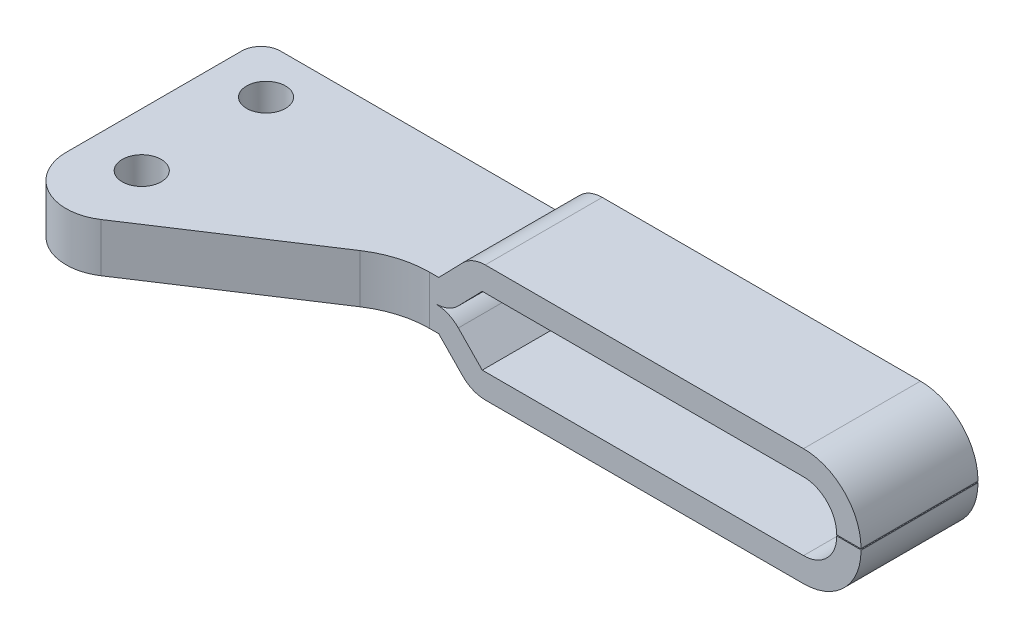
ISO-10303-21;
HEADER;
FILE_DESCRIPTION(('STEP AP214'),'2;1');
FILE_NAME('part.step','',(''),(''),'','','');
FILE_SCHEMA(('AUTOMOTIVE_DESIGN { 1 0 10303 214 1 1 1 1 }'));
ENDSEC;
DATA;
#1=APPLICATION_CONTEXT('core data for automotive mechanical design processes');
#2=APPLICATION_PROTOCOL_DEFINITION('international standard','automotive_design',2000,#1);
#3=PRODUCT_CONTEXT('',#1,'mechanical');
#4=PRODUCT('Part','Part','',(#3));
#5=PRODUCT_RELATED_PRODUCT_CATEGORY('part','',(#4));
#6=PRODUCT_DEFINITION_FORMATION('','',#4);
#7=PRODUCT_DEFINITION_CONTEXT('part definition',#1,'design');
#8=PRODUCT_DEFINITION('design','',#6,#7);
#9=PRODUCT_DEFINITION_SHAPE('','',#8);
#10=(LENGTH_UNIT() NAMED_UNIT(*) SI_UNIT(.MILLI.,.METRE.));
#11=(NAMED_UNIT(*) PLANE_ANGLE_UNIT() SI_UNIT($,.RADIAN.));
#12=(NAMED_UNIT(*) SI_UNIT($,.STERADIAN.) SOLID_ANGLE_UNIT());
#13=UNCERTAINTY_MEASURE_WITH_UNIT(LENGTH_MEASURE(1.E-05),#10,'distance_accuracy_value','');
#14=(GEOMETRIC_REPRESENTATION_CONTEXT(3) GLOBAL_UNCERTAINTY_ASSIGNED_CONTEXT((#13)) GLOBAL_UNIT_ASSIGNED_CONTEXT((#10,
#11,#12)) REPRESENTATION_CONTEXT('',''));
#15=CARTESIAN_POINT('',(0.,0.,0.));
#16=DIRECTION('',(0.,0.,1.));
#17=DIRECTION('',(1.,0.,0.));
#18=AXIS2_PLACEMENT_3D('',#15,#16,#17);
#19=CARTESIAN_POINT('',(4.37568668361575,18.4305081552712,-15.7399959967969));
#20=DIRECTION('',(-0.716910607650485,-0.697165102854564,0.));
#21=DIRECTION('',(-0.697165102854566,0.716910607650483,0.));
#22=AXIS2_PLACEMENT_3D('',#19,#20,#21);
#23=PLANE('',#22);
#24=DIRECTION('',(0.697165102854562,-0.716910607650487,0.));
#25=VECTOR('',#24,1.);
#26=CARTESIAN_POINT('',(24.946640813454,-2.72306818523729,-17.7399959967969));
#27=LINE('',#26,#25);
#28=CARTESIAN_POINT('',(24.7297164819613,-2.49999999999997,-17.7399959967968));
#29=VERTEX_POINT('',#28);
#30=CARTESIAN_POINT('',(27.1817485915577,-5.02147995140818,-17.7399959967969));
#31=VERTEX_POINT('',#30);
#32=EDGE_CURVE('E334',#29,#31,#27,.T.);
#33=ORIENTED_EDGE('',*,*,#32,.T.);
#34=DIRECTION('',(0.,0.,-1.));
#35=VECTOR('',#34,1.);
#36=CARTESIAN_POINT('',(27.1817485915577,-5.02147995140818,-15.7399959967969));
#37=LINE('',#36,#35);
#38=CARTESIAN_POINT('',(27.1817485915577,-5.02147995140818,-5.7399959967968));
#39=VERTEX_POINT('',#38);
#40=EDGE_CURVE('E349',#31,#39,#37,.F.);
#41=ORIENTED_EDGE('',*,*,#40,.T.);
#42=DIRECTION('',(-0.697165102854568,0.716910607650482,0.));
#43=VECTOR('',#42,1.);
#44=CARTESIAN_POINT('',(27.1817485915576,-5.02147995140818,-5.73999599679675));
#45=LINE('',#44,#43);
#46=CARTESIAN_POINT('',(24.7297164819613,-2.49999999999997,-5.73999599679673));
#47=VERTEX_POINT('',#46);
#48=EDGE_CURVE('E328',#39,#47,#45,.T.);
#49=ORIENTED_EDGE('',*,*,#48,.T.);
#50=DIRECTION('',(0.,0.,1.));
#51=VECTOR('',#50,1.);
#52=CARTESIAN_POINT('',(24.7297164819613,-2.49999999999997,-15.7399959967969));
#53=LINE('',#52,#51);
#54=EDGE_CURVE('E331',#29,#47,#53,.T.);
#55=ORIENTED_EDGE('',*,*,#54,.F.);
#56=EDGE_LOOP('',(#33,#41,#49,#55));
#57=FACE_BOUND('',#56,.T.);
#58=ADVANCED_FACE('F17',(#57),#23,.T.);
#59=CARTESIAN_POINT('',(29.5021014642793,-2.76503537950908,-24.1000840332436));
#60=DIRECTION('',(0.,0.,1.));
#61=DIRECTION('',(0.,1.,0.));
#62=AXIS2_PLACEMENT_3D('',#59,#60,#61);
#63=CYLINDRICAL_SURFACE('',#62,3.2366);
#64=ORIENTED_EDGE('',*,*,#40,.F.);
#65=CARTESIAN_POINT('',(29.5021014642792,-2.76503537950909,-17.7399959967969));
#66=DIRECTION('',(0.,0.,1.));
#67=DIRECTION('',(0.,1.,0.));
#68=AXIS2_PLACEMENT_3D('',#65,#66,#67);
#69=CIRCLE('',#68,3.2366);
#70=CARTESIAN_POINT('',(29.5021014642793,-6.00163537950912,-17.7399959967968));
#71=VERTEX_POINT('',#70);
#72=EDGE_CURVE('E329',#71,#31,#69,.F.);
#73=ORIENTED_EDGE('',*,*,#72,.F.);
#74=DIRECTION('',(0.,0.,1.));
#75=VECTOR('',#74,1.);
#76=CARTESIAN_POINT('',(29.5021014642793,-6.0016353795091,-24.1000840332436));
#77=LINE('',#76,#75);
#78=CARTESIAN_POINT('',(29.5021014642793,-6.00163537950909,-5.73999599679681));
#79=VERTEX_POINT('',#78);
#80=EDGE_CURVE('E356',#71,#79,#77,.T.);
#81=ORIENTED_EDGE('',*,*,#80,.T.);
#82=CARTESIAN_POINT('',(29.5021014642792,-2.76503537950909,-5.73999599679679));
#83=DIRECTION('',(0.,0.,1.));
#84=DIRECTION('',(0.,1.,0.));
#85=AXIS2_PLACEMENT_3D('',#82,#83,#84);
#86=CIRCLE('',#85,3.2366);
#87=EDGE_CURVE('E351',#39,#79,#86,.T.);
#88=ORIENTED_EDGE('',*,*,#87,.F.);
#89=EDGE_LOOP('',(#64,#73,#81,#88));
#90=FACE_BOUND('',#89,.T.);
#91=ADVANCED_FACE('F491',(#90),#63,.T.);
#92=CARTESIAN_POINT('',(-4.79847823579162,-6.00163537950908,-15.7399959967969));
#93=DIRECTION('',(0.,-1.,0.));
#94=DIRECTION('',(0.,0.,1.));
#95=AXIS2_PLACEMENT_3D('',#92,#93,#94);
#96=PLANE('',#95);
#97=ORIENTED_EDGE('',*,*,#80,.F.);
#98=DIRECTION('',(-1.,0.,0.));
#99=VECTOR('',#98,1.);
#100=CARTESIAN_POINT('',(69.5080963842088,-6.00163537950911,-17.7399959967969));
#101=LINE('',#100,#99);
#102=CARTESIAN_POINT('',(62.1500000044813,-6.00163537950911,-17.7399959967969));
#103=VERTEX_POINT('',#102);
#104=EDGE_CURVE('E361',#71,#103,#101,.F.);
#105=ORIENTED_EDGE('',*,*,#104,.T.);
#106=DIRECTION('',(0.,0.,1.));
#107=VECTOR('',#106,1.);
#108=CARTESIAN_POINT('',(62.1500000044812,-6.0016353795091,-15.7399959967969));
#109=LINE('',#108,#107);
#110=CARTESIAN_POINT('',(62.1500000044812,-6.0016353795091,-5.73999599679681));
#111=VERTEX_POINT('',#110);
#112=EDGE_CURVE('E370',#103,#111,#109,.T.);
#113=ORIENTED_EDGE('',*,*,#112,.T.);
#114=DIRECTION('',(1.,0.,0.));
#115=VECTOR('',#114,1.);
#116=CARTESIAN_POINT('',(19.5080963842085,-6.0016353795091,-5.73999599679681));
#117=LINE('',#116,#115);
#118=EDGE_CURVE('E364',#111,#79,#117,.F.);
#119=ORIENTED_EDGE('',*,*,#118,.T.);
#120=EDGE_LOOP('',(#97,#105,#113,#119));
#121=FACE_BOUND('',#120,.T.);
#122=ADVANCED_FACE('F497',(#121),#96,.T.);
#123=CARTESIAN_POINT('',(62.1500000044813,-0.10163537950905,-26.008891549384));
#124=DIRECTION('',(0.,0.,1.));
#125=DIRECTION('',(-1.,0.,0.));
#126=AXIS2_PLACEMENT_3D('',#123,#124,#125);
#127=CYLINDRICAL_SURFACE('',#126,5.9);
#128=DIRECTION('',(0.,0.,1.));
#129=VECTOR('',#128,1.);
#130=CARTESIAN_POINT('',(68.0500000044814,-0.101635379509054,-26.008891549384));
#131=LINE('',#130,#129);
#132=CARTESIAN_POINT('',(68.0500000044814,-0.101635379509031,-17.7399959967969));
#133=VERTEX_POINT('',#132);
#134=CARTESIAN_POINT('',(68.0500000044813,-0.101635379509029,-5.73999599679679));
#135=VERTEX_POINT('',#134);
#136=EDGE_CURVE('E386',#133,#135,#131,.T.);
#137=ORIENTED_EDGE('',*,*,#136,.T.);
#138=CARTESIAN_POINT('',(62.1500000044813,-0.101635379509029,-5.73999599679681));
#139=DIRECTION('',(0.,0.,1.));
#140=DIRECTION('',(-1.,0.,0.));
#141=AXIS2_PLACEMENT_3D('',#138,#139,#140);
#142=CIRCLE('',#141,5.9);
#143=EDGE_CURVE('E379',#111,#135,#142,.T.);
#144=ORIENTED_EDGE('',*,*,#143,.F.);
#145=ORIENTED_EDGE('',*,*,#112,.F.);
#146=CARTESIAN_POINT('',(62.1500000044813,-0.101635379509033,-17.7399959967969));
#147=DIRECTION('',(0.,0.,1.));
#148=DIRECTION('',(-1.,0.,0.));
#149=AXIS2_PLACEMENT_3D('',#146,#147,#148);
#150=CIRCLE('',#149,5.9);
#151=EDGE_CURVE('E373',#133,#103,#150,.F.);
#152=ORIENTED_EDGE('',*,*,#151,.F.);
#153=EDGE_LOOP('',(#137,#144,#145,#152));
#154=FACE_BOUND('',#153,.T.);
#155=ADVANCED_FACE('F515',(#154),#127,.T.);
#156=CARTESIAN_POINT('',(68.0500000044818,-74.354316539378,-15.7399959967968));
#157=DIRECTION('',(1.,0.,0.));
#158=DIRECTION('',(0.,-1.,0.));
#159=AXIS2_PLACEMENT_3D('',#156,#157,#158);
#160=PLANE('',#159);
#161=DIRECTION('',(0.,-1.,0.));
#162=VECTOR('',#161,1.);
#163=CARTESIAN_POINT('',(68.0500000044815,-0.0477419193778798,-17.7399959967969));
#164=LINE('',#163,#162);
#165=CARTESIAN_POINT('',(68.0500000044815,-0.0477419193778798,-17.7399959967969));
#166=VERTEX_POINT('',#165);
#167=EDGE_CURVE('E391',#133,#166,#164,.F.);
#168=ORIENTED_EDGE('',*,*,#167,.T.);
#169=DIRECTION('',(0.,0.,-1.));
#170=VECTOR('',#169,1.);
#171=CARTESIAN_POINT('',(68.0500000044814,-0.0477419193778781,-5.73999599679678));
#172=LINE('',#171,#170);
#173=CARTESIAN_POINT('',(68.0500000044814,-0.0477419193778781,-5.73999599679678));
#174=VERTEX_POINT('',#173);
#175=EDGE_CURVE('E300',#166,#174,#172,.F.);
#176=ORIENTED_EDGE('',*,*,#175,.T.);
#177=DIRECTION('',(0.,-1.,0.));
#178=VECTOR('',#177,1.);
#179=CARTESIAN_POINT('',(68.0500000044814,-50.0477419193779,-5.73999599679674));
#180=LINE('',#179,#178);
#181=EDGE_CURVE('E394',#174,#135,#180,.T.);
#182=ORIENTED_EDGE('',*,*,#181,.T.);
#183=ORIENTED_EDGE('',*,*,#136,.F.);
#184=EDGE_LOOP('',(#168,#176,#182,#183));
#185=FACE_BOUND('',#184,.T.);
#186=ADVANCED_FACE('F523',(#185),#160,.T.);
#187=CARTESIAN_POINT('',(68.0500000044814,-0.0477419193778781,-5.73999599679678));
#188=DIRECTION('',(0.,-1.,0.));
#189=DIRECTION('',(-1.,0.,0.));
#190=AXIS2_PLACEMENT_3D('',#187,#188,#189);
#191=PLANE('',#190);
#192=DIRECTION('',(1.,0.,0.));
#193=VECTOR('',#192,1.);
#194=CARTESIAN_POINT('',(68.0500000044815,-0.0477419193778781,-5.73999599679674));
#195=LINE('',#194,#193);
#196=CARTESIAN_POINT('',(65.5500000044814,-0.0477419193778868,-5.73999599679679));
#197=VERTEX_POINT('',#196);
#198=EDGE_CURVE('E399',#197,#174,#195,.T.);
#199=ORIENTED_EDGE('',*,*,#198,.T.);
#200=ORIENTED_EDGE('',*,*,#175,.F.);
#201=DIRECTION('',(-1.,0.,0.));
#202=VECTOR('',#201,1.);
#203=CARTESIAN_POINT('',(68.0500000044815,-0.0477419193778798,-17.7399959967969));
#204=LINE('',#203,#202);
#205=CARTESIAN_POINT('',(65.5500000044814,-0.0477419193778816,-17.7399959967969));
#206=VERTEX_POINT('',#205);
#207=EDGE_CURVE('E390',#166,#206,#204,.T.);
#208=ORIENTED_EDGE('',*,*,#207,.T.);
#209=DIRECTION('',(0.,0.,-1.));
#210=VECTOR('',#209,1.);
#211=CARTESIAN_POINT('',(65.5500000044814,-0.047741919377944,-15.7399959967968));
#212=LINE('',#211,#210);
#213=EDGE_CURVE('E380',#206,#197,#212,.F.);
#214=ORIENTED_EDGE('',*,*,#213,.T.);
#215=EDGE_LOOP('',(#199,#200,#208,#214));
#216=FACE_BOUND('',#215,.T.);
#217=ADVANCED_FACE('F519',(#216),#191,.F.);
#218=CARTESIAN_POINT('',(65.5500000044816,-74.3543165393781,-15.7399959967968));
#219=DIRECTION('',(1.,0.,0.));
#220=DIRECTION('',(0.,-1.,0.));
#221=AXIS2_PLACEMENT_3D('',#218,#219,#220);
#222=PLANE('',#221);
#223=DIRECTION('',(0.,-1.,0.));
#224=VECTOR('',#223,1.);
#225=CARTESIAN_POINT('',(65.5500000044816,-74.3543165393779,-5.73999599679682));
#226=LINE('',#225,#224);
#227=CARTESIAN_POINT('',(65.5500000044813,-0.101635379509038,-5.73999599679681));
#228=VERTEX_POINT('',#227);
#229=EDGE_CURVE('E377',#197,#228,#226,.T.);
#230=ORIENTED_EDGE('',*,*,#229,.F.);
#231=ORIENTED_EDGE('',*,*,#213,.F.);
#232=DIRECTION('',(0.,-1.,0.));
#233=VECTOR('',#232,1.);
#234=CARTESIAN_POINT('',(65.5500000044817,-74.3543165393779,-17.7399959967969));
#235=LINE('',#234,#233);
#236=CARTESIAN_POINT('',(65.5500000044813,-0.101635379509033,-17.7399959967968));
#237=VERTEX_POINT('',#236);
#238=EDGE_CURVE('E383',#237,#206,#235,.F.);
#239=ORIENTED_EDGE('',*,*,#238,.F.);
#240=DIRECTION('',(0.,0.,1.));
#241=VECTOR('',#240,1.);
#242=CARTESIAN_POINT('',(65.5500000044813,-0.101635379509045,-26.008891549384));
#243=LINE('',#242,#241);
#244=EDGE_CURVE('E374',#237,#228,#243,.T.);
#245=ORIENTED_EDGE('',*,*,#244,.T.);
#246=EDGE_LOOP('',(#230,#231,#239,#245));
#247=FACE_BOUND('',#246,.T.);
#248=ADVANCED_FACE('F511',(#247),#222,.F.);
#249=CARTESIAN_POINT('',(62.1500000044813,-0.10163537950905,-26.008891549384));
#250=DIRECTION('',(0.,0.,1.));
#251=DIRECTION('',(-1.,0.,0.));
#252=AXIS2_PLACEMENT_3D('',#249,#250,#251);
#253=CYLINDRICAL_SURFACE('',#252,3.4);
#254=CARTESIAN_POINT('',(62.1500000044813,-0.101635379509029,-5.73999599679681));
#255=DIRECTION('',(0.,0.,1.));
#256=DIRECTION('',(-1.,0.,0.));
#257=AXIS2_PLACEMENT_3D('',#254,#255,#256);
#258=CIRCLE('',#257,3.4);
#259=CARTESIAN_POINT('',(62.1500000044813,-3.50163537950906,-5.7399959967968));
#260=VERTEX_POINT('',#259);
#261=EDGE_CURVE('E367',#228,#260,#258,.F.);
#262=ORIENTED_EDGE('',*,*,#261,.F.);
#263=ORIENTED_EDGE('',*,*,#244,.F.);
#264=CARTESIAN_POINT('',(62.1500000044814,-0.101635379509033,-17.7399959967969));
#265=DIRECTION('',(0.,0.,1.));
#266=DIRECTION('',(-1.,0.,0.));
#267=AXIS2_PLACEMENT_3D('',#264,#265,#266);
#268=CIRCLE('',#267,3.4);
#269=CARTESIAN_POINT('',(62.1500000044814,-3.50163537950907,-17.7399959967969));
#270=VERTEX_POINT('',#269);
#271=EDGE_CURVE('E372',#270,#237,#268,.T.);
#272=ORIENTED_EDGE('',*,*,#271,.F.);
#273=DIRECTION('',(0.,0.,1.));
#274=VECTOR('',#273,1.);
#275=CARTESIAN_POINT('',(62.1500000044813,-3.50163537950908,-15.7399959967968));
#276=LINE('',#275,#274);
#277=EDGE_CURVE('E355',#270,#260,#276,.T.);
#278=ORIENTED_EDGE('',*,*,#277,.T.);
#279=EDGE_LOOP('',(#262,#263,#272,#278));
#280=FACE_BOUND('',#279,.T.);
#281=ADVANCED_FACE('F506',(#280),#253,.F.);
#282=CARTESIAN_POINT('',(-4.79847823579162,-3.50163537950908,-15.7399959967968));
#283=DIRECTION('',(0.,-1.,0.));
#284=DIRECTION('',(0.,0.,1.));
#285=AXIS2_PLACEMENT_3D('',#282,#283,#284);
#286=PLANE('',#285);
#287=ORIENTED_EDGE('',*,*,#277,.F.);
#288=DIRECTION('',(-1.,0.,0.));
#289=VECTOR('',#288,1.);
#290=CARTESIAN_POINT('',(-4.79847823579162,-3.50163537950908,-17.7399959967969));
#291=LINE('',#290,#289);
#292=CARTESIAN_POINT('',(29.1909494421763,-3.50163537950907,-17.7399959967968));
#293=VERTEX_POINT('',#292);
#294=EDGE_CURVE('E352',#293,#270,#291,.F.);
#295=ORIENTED_EDGE('',*,*,#294,.F.);
#296=DIRECTION('',(0.,0.,1.));
#297=VECTOR('',#296,1.);
#298=CARTESIAN_POINT('',(29.1909494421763,-3.50163537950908,-15.7399959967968));
#299=LINE('',#298,#297);
#300=CARTESIAN_POINT('',(29.1909494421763,-3.50163537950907,-5.73999599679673));
#301=VERTEX_POINT('',#300);
#302=EDGE_CURVE('E326',#293,#301,#299,.T.);
#303=ORIENTED_EDGE('',*,*,#302,.T.);
#304=DIRECTION('',(-1.,0.,0.));
#305=VECTOR('',#304,1.);
#306=CARTESIAN_POINT('',(-4.79847823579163,-3.50163537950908,-5.73999599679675));
#307=LINE('',#306,#305);
#308=EDGE_CURVE('E357',#260,#301,#307,.T.);
#309=ORIENTED_EDGE('',*,*,#308,.F.);
#310=EDGE_LOOP('',(#287,#295,#303,#309));
#311=FACE_BOUND('',#310,.T.);
#312=ADVANCED_FACE('F504',(#311),#286,.F.);
#313=CARTESIAN_POINT('',(24.4185644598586,-3.2366,-5.73999599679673));
#314=DIRECTION('',(0.,0.,-1.));
#315=DIRECTION('',(0.,-1.,0.));
#316=AXIS2_PLACEMENT_3D('',#313,#314,#315);
#317=PLANE('',#316);
#318=CARTESIAN_POINT('',(24.4185644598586,-3.2366,-5.73999599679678));
#319=DIRECTION('',(0.,0.,1.));
#320=DIRECTION('',(0.,1.,0.));
#321=AXIS2_PLACEMENT_3D('',#318,#319,#320);
#322=CIRCLE('',#321,3.2366);
#323=CARTESIAN_POINT('',(24.4185644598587,0.,-5.73999599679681));
#324=VERTEX_POINT('',#323);
#325=CARTESIAN_POINT('',(26.7389173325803,-0.98015542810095,-5.7399959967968));
#326=VERTEX_POINT('',#325);
#327=EDGE_CURVE('E420',#324,#326,#322,.F.);
#328=ORIENTED_EDGE('',*,*,#327,.F.);
#329=CARTESIAN_POINT('',(24.4185644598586,3.23660000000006,-5.73999599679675));
#330=DIRECTION('',(0.,0.,1.));
#331=DIRECTION('',(0.,1.,0.));
#332=AXIS2_PLACEMENT_3D('',#329,#330,#331);
#333=CIRCLE('',#332,3.2366);
#334=CARTESIAN_POINT('',(26.7389173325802,0.980155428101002,-5.73999599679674));
#335=VERTEX_POINT('',#334);
#336=EDGE_CURVE('E311',#335,#324,#333,.F.);
#337=ORIENTED_EDGE('',*,*,#336,.F.);
#338=DIRECTION('',(-0.697165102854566,-0.716910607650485,0.));
#339=VECTOR('',#338,1.);
#340=CARTESIAN_POINT('',(6.16796320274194,-20.1734209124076,-5.73999599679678));
#341=LINE('',#340,#339);
#342=CARTESIAN_POINT('',(29.1909494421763,3.50163537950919,-5.73999599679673));
#343=VERTEX_POINT('',#342);
#344=EDGE_CURVE('E227',#343,#335,#341,.T.);
#345=ORIENTED_EDGE('',*,*,#344,.F.);
#346=DIRECTION('',(-1.,0.,0.));
#347=VECTOR('',#346,1.);
#348=CARTESIAN_POINT('',(-4.79847823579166,3.50163537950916,-5.73999599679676));
#349=LINE('',#348,#347);
#350=CARTESIAN_POINT('',(62.1500000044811,3.5016353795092,-5.73999599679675));
#351=VERTEX_POINT('',#350);
#352=EDGE_CURVE('E236',#351,#343,#349,.T.);
#353=ORIENTED_EDGE('',*,*,#352,.F.);
#354=CARTESIAN_POINT('',(62.1500000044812,0.10163537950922,-5.73999599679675));
#355=DIRECTION('',(0.,0.,1.));
#356=DIRECTION('',(-1.,0.,0.));
#357=AXIS2_PLACEMENT_3D('',#354,#355,#356);
#358=CIRCLE('',#357,3.4);
#359=CARTESIAN_POINT('',(65.5500000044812,0.101635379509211,-5.73999599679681));
#360=VERTEX_POINT('',#359);
#361=EDGE_CURVE('E253',#351,#360,#358,.F.);
#362=ORIENTED_EDGE('',*,*,#361,.T.);
#363=DIRECTION('',(0.,1.,0.));
#364=VECTOR('',#363,1.);
#365=CARTESIAN_POINT('',(65.5500000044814,74.3543165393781,-5.73999599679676));
#366=LINE('',#365,#364);
#367=CARTESIAN_POINT('',(65.5500000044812,0.0477419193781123,-5.73999599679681));
#368=VERTEX_POINT('',#367);
#369=EDGE_CURVE('E262',#368,#360,#366,.T.);
#370=ORIENTED_EDGE('',*,*,#369,.F.);
#371=DIRECTION('',(1.,0.,0.));
#372=VECTOR('',#371,1.);
#373=CARTESIAN_POINT('',(65.5500000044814,0.0477419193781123,-5.7399959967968));
#374=LINE('',#373,#372);
#375=CARTESIAN_POINT('',(68.0500000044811,0.047741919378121,-5.73999599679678));
#376=VERTEX_POINT('',#375);
#377=EDGE_CURVE('E279',#376,#368,#374,.F.);
#378=ORIENTED_EDGE('',*,*,#377,.F.);
#379=DIRECTION('',(0.,-1.,0.));
#380=VECTOR('',#379,1.);
#381=CARTESIAN_POINT('',(68.050000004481,50.0477419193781,-5.7399959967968));
#382=LINE('',#381,#380);
#383=CARTESIAN_POINT('',(68.0500000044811,0.101635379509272,-5.7399959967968));
#384=VERTEX_POINT('',#383);
#385=EDGE_CURVE('E277',#384,#376,#382,.T.);
#386=ORIENTED_EDGE('',*,*,#385,.F.);
#387=CARTESIAN_POINT('',(62.1500000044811,0.10163537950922,-5.73999599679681));
#388=DIRECTION('',(0.,0.,1.));
#389=DIRECTION('',(-1.,0.,0.));
#390=AXIS2_PLACEMENT_3D('',#387,#388,#389);
#391=CIRCLE('',#390,5.9);
#392=CARTESIAN_POINT('',(62.1500000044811,6.00163537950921,-5.73999599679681));
#393=VERTEX_POINT('',#392);
#394=EDGE_CURVE('E289',#393,#384,#391,.F.);
#395=ORIENTED_EDGE('',*,*,#394,.F.);
#396=DIRECTION('',(1.,0.,0.));
#397=VECTOR('',#396,1.);
#398=CARTESIAN_POINT('',(19.5080963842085,6.00163537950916,-5.73999599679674));
#399=LINE('',#398,#397);
#400=CARTESIAN_POINT('',(29.5021014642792,6.00163537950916,-5.73999599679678));
#401=VERTEX_POINT('',#400);
#402=EDGE_CURVE('E245',#401,#393,#399,.T.);
#403=ORIENTED_EDGE('',*,*,#402,.F.);
#404=CARTESIAN_POINT('',(29.5021014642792,2.76503537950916,-5.73999599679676));
#405=DIRECTION('',(0.,0.,1.));
#406=DIRECTION('',(0.,1.,0.));
#407=AXIS2_PLACEMENT_3D('',#404,#405,#406);
#408=CIRCLE('',#407,3.2366);
#409=CARTESIAN_POINT('',(27.1817485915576,5.02147995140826,-5.73999599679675));
#410=VERTEX_POINT('',#409);
#411=EDGE_CURVE('E235',#410,#401,#408,.F.);
#412=ORIENTED_EDGE('',*,*,#411,.F.);
#413=DIRECTION('',(0.697165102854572,0.716910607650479,0.));
#414=VECTOR('',#413,1.);
#415=CARTESIAN_POINT('',(24.9466408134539,2.7230681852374,-5.73999599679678));
#416=LINE('',#415,#414);
#417=CARTESIAN_POINT('',(24.7297164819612,2.50000000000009,-5.73999599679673));
#418=VERTEX_POINT('',#417);
#419=EDGE_CURVE('E193',#418,#410,#416,.T.);
#420=ORIENTED_EDGE('',*,*,#419,.F.);
#421=DIRECTION('',(-1.,0.,0.));
#422=VECTOR('',#421,1.);
#423=CARTESIAN_POINT('',(-3.50000000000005,2.5,-5.7399959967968));
#424=LINE('',#423,#422);
#425=CARTESIAN_POINT('',(23.7944274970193,2.50000000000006,-5.73999599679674));
#426=VERTEX_POINT('',#425);
#427=EDGE_CURVE('E218',#418,#426,#424,.T.);
#428=ORIENTED_EDGE('',*,*,#427,.T.);
#429=DIRECTION('',(0.,-1.,0.));
#430=VECTOR('',#429,1.);
#431=CARTESIAN_POINT('',(23.7944274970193,-2.5,-5.73999599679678));
#432=LINE('',#431,#430);
#433=CARTESIAN_POINT('',(23.7944274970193,-2.5,-5.73999599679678));
#434=VERTEX_POINT('',#433);
#435=EDGE_CURVE('E433',#426,#434,#432,.T.);
#436=ORIENTED_EDGE('',*,*,#435,.T.);
#437=DIRECTION('',(-1.,0.,0.));
#438=VECTOR('',#437,1.);
#439=CARTESIAN_POINT('',(-3.5,-2.5,-5.73999599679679));
#440=LINE('',#439,#438);
#441=EDGE_CURVE('E333',#47,#434,#440,.T.);
#442=ORIENTED_EDGE('',*,*,#441,.F.);
#443=ORIENTED_EDGE('',*,*,#48,.F.);
#444=ORIENTED_EDGE('',*,*,#87,.T.);
#445=ORIENTED_EDGE('',*,*,#118,.F.);
#446=ORIENTED_EDGE('',*,*,#143,.T.);
#447=ORIENTED_EDGE('',*,*,#181,.F.);
#448=ORIENTED_EDGE('',*,*,#198,.F.);
#449=ORIENTED_EDGE('',*,*,#229,.T.);
#450=ORIENTED_EDGE('',*,*,#261,.T.);
#451=ORIENTED_EDGE('',*,*,#308,.T.);
#452=DIRECTION('',(-0.697165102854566,0.716910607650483,0.));
#453=VECTOR('',#452,1.);
#454=CARTESIAN_POINT('',(6.16796320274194,20.1734209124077,-5.73999599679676));
#455=LINE('',#454,#453);
#456=EDGE_CURVE('E440',#301,#326,#455,.T.);
#457=ORIENTED_EDGE('',*,*,#456,.T.);
#458=EDGE_LOOP('',(#328,#337,#345,#353,#362,#370,#378,#386,#395,#403,#412,#420,#428,#436,#442,
#443,#444,#445,#446,#447,#448,#449,#450,#451,#457));
#459=FACE_BOUND('',#458,.T.);
#460=ADVANCED_FACE('F470',(#459),#317,.F.);
#461=CARTESIAN_POINT('',(23.7944274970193,-2.5,4.26000400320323));
#462=DIRECTION('',(0.,-1.,0.));
#463=DIRECTION('',(0.,0.,1.));
#464=AXIS2_PLACEMENT_3D('',#461,#462,#463);
#465=CYLINDRICAL_SURFACE('',#464,10.);
#466=ORIENTED_EDGE('',*,*,#435,.F.);
#467=CARTESIAN_POINT('',(23.7944274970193,2.50000000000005,4.26000400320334));
#468=DIRECTION('',(0.,-1.,0.));
#469=DIRECTION('',(0.,0.,1.));
#470=AXIS2_PLACEMENT_3D('',#467,#468,#469);
#471=CIRCLE('',#470,10.);
#472=CARTESIAN_POINT('',(18.3084678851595,2.50000000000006,-4.10087197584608));
#473=VERTEX_POINT('',#472);
#474=EDGE_CURVE('E306',#473,#426,#471,.T.);
#475=ORIENTED_EDGE('',*,*,#474,.F.);
#476=DIRECTION('',(0.,-1.,0.));
#477=VECTOR('',#476,1.);
#478=CARTESIAN_POINT('',(18.3084678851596,-2.49999999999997,-4.10087197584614));
#479=LINE('',#478,#477);
#480=CARTESIAN_POINT('',(18.3084678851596,-2.5,-4.10087197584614));
#481=VERTEX_POINT('',#480);
#482=EDGE_CURVE('E432',#473,#481,#479,.T.);
#483=ORIENTED_EDGE('',*,*,#482,.T.);
#484=CARTESIAN_POINT('',(23.7944274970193,-2.5,4.26000400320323));
#485=DIRECTION('',(0.,-1.,0.));
#486=DIRECTION('',(0.,0.,1.));
#487=AXIS2_PLACEMENT_3D('',#484,#485,#486);
#488=CIRCLE('',#487,10.);
#489=EDGE_CURVE('E430',#434,#481,#488,.F.);
#490=ORIENTED_EDGE('',*,*,#489,.F.);
#491=EDGE_LOOP('',(#466,#475,#483,#490));
#492=FACE_BOUND('',#491,.T.);
#493=ADVANCED_FACE('F599',(#492),#465,.F.);
#494=CARTESIAN_POINT('',(2.24297980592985,-2.49999999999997,6.44044199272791));
#495=DIRECTION('',(-0.548595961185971,0.,-0.836087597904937));
#496=DIRECTION('',(0.836087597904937,0.,-0.548595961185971));
#497=AXIS2_PLACEMENT_3D('',#494,#495,#496);
#498=PLANE('',#497);
#499=ORIENTED_EDGE('',*,*,#482,.F.);
#500=DIRECTION('',(0.836087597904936,0.,-0.548595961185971));
#501=VECTOR('',#500,1.);
#502=CARTESIAN_POINT('',(2.24297980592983,2.50000000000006,6.44044199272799));
#503=LINE('',#502,#501);
#504=CARTESIAN_POINT('',(2.24297980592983,2.50000000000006,6.44044199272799));
#505=VERTEX_POINT('',#504);
#506=EDGE_CURVE('E305',#505,#473,#503,.T.);
#507=ORIENTED_EDGE('',*,*,#506,.F.);
#508=DIRECTION('',(0.,1.,0.));
#509=VECTOR('',#508,1.);
#510=CARTESIAN_POINT('',(2.24297980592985,-2.49999999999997,6.44044199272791));
#511=LINE('',#510,#509);
#512=CARTESIAN_POINT('',(2.24297980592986,-2.5,6.44044199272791));
#513=VERTEX_POINT('',#512);
#514=EDGE_CURVE('E429',#513,#505,#511,.T.);
#515=ORIENTED_EDGE('',*,*,#514,.F.);
#516=DIRECTION('',(0.836087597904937,0.,-0.548595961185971));
#517=VECTOR('',#516,1.);
#518=CARTESIAN_POINT('',(2.24297980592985,-2.5,6.44044199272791));
#519=LINE('',#518,#517);
#520=EDGE_CURVE('E346',#481,#513,#519,.F.);
#521=ORIENTED_EDGE('',*,*,#520,.F.);
#522=EDGE_LOOP('',(#499,#507,#515,#521));
#523=FACE_BOUND('',#522,.T.);
#524=ADVANCED_FACE('F583',(#523),#498,.F.);
#525=CARTESIAN_POINT('',(-0.499999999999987,-2.49999999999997,2.26000400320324));
#526=DIRECTION('',(0.,1.,0.));
#527=DIRECTION('',(0.,0.,-1.));
#528=AXIS2_PLACEMENT_3D('',#525,#526,#527);
#529=CYLINDRICAL_SURFACE('',#528,5.);
#530=CARTESIAN_POINT('',(-0.499999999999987,-2.49999999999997,2.26000400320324));
#531=DIRECTION('',(0.,1.,0.));
#532=DIRECTION('',(0.,0.,-1.));
#533=AXIS2_PLACEMENT_3D('',#530,#531,#532);
#534=CIRCLE('',#533,5.);
#535=CARTESIAN_POINT('',(-5.5,-2.49999999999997,2.26000400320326));
#536=VERTEX_POINT('',#535);
#537=EDGE_CURVE('E427',#536,#513,#534,.T.);
#538=ORIENTED_EDGE('',*,*,#537,.T.);
#539=ORIENTED_EDGE('',*,*,#514,.T.);
#540=CARTESIAN_POINT('',(-0.500000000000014,2.50000000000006,2.26000400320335));
#541=DIRECTION('',(0.,1.,0.));
#542=DIRECTION('',(0.,0.,-1.));
#543=AXIS2_PLACEMENT_3D('',#540,#541,#542);
#544=CIRCLE('',#543,5.);
#545=CARTESIAN_POINT('',(-5.5,2.50000000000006,2.26000400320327));
#546=VERTEX_POINT('',#545);
#547=EDGE_CURVE('E302',#505,#546,#544,.F.);
#548=ORIENTED_EDGE('',*,*,#547,.T.);
#549=DIRECTION('',(0.,-1.,0.));
#550=VECTOR('',#549,1.);
#551=CARTESIAN_POINT('',(-5.5,-2.49999999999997,2.26000400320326));
#552=LINE('',#551,#550);
#553=EDGE_CURVE('E565',#546,#536,#552,.T.);
#554=ORIENTED_EDGE('',*,*,#553,.T.);
#555=EDGE_LOOP('',(#538,#539,#548,#554));
#556=FACE_BOUND('',#555,.T.);
#557=ADVANCED_FACE('F585',(#556),#529,.T.);
#558=CARTESIAN_POINT('',(70.8065746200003,-2.49999999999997,-17.7399959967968));
#559=DIRECTION('',(0.,0.,1.));
#560=DIRECTION('',(0.,1.,0.));
#561=AXIS2_PLACEMENT_3D('',#558,#559,#560);
#562=PLANE('',#561);
#563=DIRECTION('',(0.,1.,0.));
#564=VECTOR('',#563,1.);
#565=CARTESIAN_POINT('',(-3.5,-2.49999999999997,-17.7399959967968));
#566=LINE('',#565,#564);
#567=CARTESIAN_POINT('',(-3.5,2.50000000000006,-17.7399959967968));
#568=VERTEX_POINT('',#567);
#569=CARTESIAN_POINT('',(-3.5,-2.49999999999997,-17.7399959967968));
#570=VERTEX_POINT('',#569);
#571=EDGE_CURVE('E207',#568,#570,#566,.F.);
#572=ORIENTED_EDGE('',*,*,#571,.F.);
#573=DIRECTION('',(-1.,0.,0.));
#574=VECTOR('',#573,1.);
#575=CARTESIAN_POINT('',(70.8065746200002,2.5000000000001,-17.7399959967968));
#576=LINE('',#575,#574);
#577=CARTESIAN_POINT('',(24.7297164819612,2.50000000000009,-17.7399959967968));
#578=VERTEX_POINT('',#577);
#579=EDGE_CURVE('E199',#578,#568,#576,.T.);
#580=ORIENTED_EDGE('',*,*,#579,.F.);
#581=DIRECTION('',(-0.697165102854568,-0.716910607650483,0.));
#582=VECTOR('',#581,1.);
#583=CARTESIAN_POINT('',(27.1817485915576,5.02147995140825,-17.7399959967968));
#584=LINE('',#583,#582);
#585=CARTESIAN_POINT('',(27.1817485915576,5.0214799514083,-17.7399959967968));
#586=VERTEX_POINT('',#585);
#587=EDGE_CURVE('E204',#586,#578,#584,.T.);
#588=ORIENTED_EDGE('',*,*,#587,.F.);
#589=CARTESIAN_POINT('',(29.5021014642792,2.76503537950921,-17.7399959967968));
#590=DIRECTION('',(0.,0.,1.));
#591=DIRECTION('',(0.,1.,0.));
#592=AXIS2_PLACEMENT_3D('',#589,#590,#591);
#593=CIRCLE('',#592,3.2366);
#594=CARTESIAN_POINT('',(29.5021014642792,6.00163537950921,-17.7399959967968));
#595=VERTEX_POINT('',#594);
#596=EDGE_CURVE('E231',#595,#586,#593,.T.);
#597=ORIENTED_EDGE('',*,*,#596,.F.);
#598=DIRECTION('',(-1.,0.,0.));
#599=VECTOR('',#598,1.);
#600=CARTESIAN_POINT('',(69.5080963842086,6.00163537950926,-17.7399959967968));
#601=LINE('',#600,#599);
#602=CARTESIAN_POINT('',(62.1500000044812,6.00163537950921,-17.7399959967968));
#603=VERTEX_POINT('',#602);
#604=EDGE_CURVE('E243',#603,#595,#601,.T.);
#605=ORIENTED_EDGE('',*,*,#604,.F.);
#606=CARTESIAN_POINT('',(62.1500000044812,0.101635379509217,-17.7399959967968));
#607=DIRECTION('',(0.,0.,1.));
#608=DIRECTION('',(-1.,0.,0.));
#609=AXIS2_PLACEMENT_3D('',#606,#607,#608);
#610=CIRCLE('',#609,5.9);
#611=CARTESIAN_POINT('',(68.0500000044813,0.10163537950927,-17.7399959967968));
#612=VERTEX_POINT('',#611);
#613=EDGE_CURVE('E254',#612,#603,#610,.T.);
#614=ORIENTED_EDGE('',*,*,#613,.F.);
#615=DIRECTION('',(0.,-1.,0.));
#616=VECTOR('',#615,1.);
#617=CARTESIAN_POINT('',(68.0500000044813,0.0477419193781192,-17.7399959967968));
#618=LINE('',#617,#616);
#619=CARTESIAN_POINT('',(68.0500000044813,0.0477419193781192,-17.7399959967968));
#620=VERTEX_POINT('',#619);
#621=EDGE_CURVE('E272',#620,#612,#618,.F.);
#622=ORIENTED_EDGE('',*,*,#621,.F.);
#623=DIRECTION('',(-1.,0.,0.));
#624=VECTOR('',#623,1.);
#625=CARTESIAN_POINT('',(65.5500000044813,0.0477419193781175,-17.7399959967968));
#626=LINE('',#625,#624);
#627=CARTESIAN_POINT('',(65.5500000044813,0.0477419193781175,-17.7399959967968));
#628=VERTEX_POINT('',#627);
#629=EDGE_CURVE('E274',#628,#620,#626,.F.);
#630=ORIENTED_EDGE('',*,*,#629,.F.);
#631=DIRECTION('',(0.,1.,0.));
#632=VECTOR('',#631,1.);
#633=CARTESIAN_POINT('',(65.5500000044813,74.3543165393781,-17.7399959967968));
#634=LINE('',#633,#632);
#635=CARTESIAN_POINT('',(65.5500000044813,0.101635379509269,-17.7399959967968));
#636=VERTEX_POINT('',#635);
#637=EDGE_CURVE('E258',#636,#628,#634,.F.);
#638=ORIENTED_EDGE('',*,*,#637,.F.);
#639=CARTESIAN_POINT('',(62.1500000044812,0.101635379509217,-17.7399959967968));
#640=DIRECTION('',(0.,0.,1.));
#641=DIRECTION('',(-1.,0.,0.));
#642=AXIS2_PLACEMENT_3D('',#639,#640,#641);
#643=CIRCLE('',#642,3.4);
#644=CARTESIAN_POINT('',(62.1500000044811,3.50163537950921,-17.7399959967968));
#645=VERTEX_POINT('',#644);
#646=EDGE_CURVE('E248',#636,#645,#643,.T.);
#647=ORIENTED_EDGE('',*,*,#646,.T.);
#648=DIRECTION('',(-1.,0.,0.));
#649=VECTOR('',#648,1.);
#650=CARTESIAN_POINT('',(-4.79847823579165,3.50163537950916,-17.7399959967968));
#651=LINE('',#650,#649);
#652=CARTESIAN_POINT('',(29.1909494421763,3.5016353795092,-17.7399959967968));
#653=VERTEX_POINT('',#652);
#654=EDGE_CURVE('E232',#653,#645,#651,.F.);
#655=ORIENTED_EDGE('',*,*,#654,.F.);
#656=DIRECTION('',(-0.697165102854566,-0.716910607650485,0.));
#657=VECTOR('',#656,1.);
#658=CARTESIAN_POINT('',(6.16796320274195,-20.1734209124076,-17.7399959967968));
#659=LINE('',#658,#657);
#660=CARTESIAN_POINT('',(26.7389173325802,0.980155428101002,-17.7399959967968));
#661=VERTEX_POINT('',#660);
#662=EDGE_CURVE('E220',#661,#653,#659,.F.);
#663=ORIENTED_EDGE('',*,*,#662,.F.);
#664=CARTESIAN_POINT('',(24.4185644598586,3.23660000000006,-17.7399959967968));
#665=DIRECTION('',(0.,0.,1.));
#666=DIRECTION('',(0.,1.,0.));
#667=AXIS2_PLACEMENT_3D('',#664,#665,#666);
#668=CIRCLE('',#667,3.2366);
#669=CARTESIAN_POINT('',(24.4185644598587,0.,-17.7399959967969));
#670=VERTEX_POINT('',#669);
#671=EDGE_CURVE('E308',#670,#661,#668,.T.);
#672=ORIENTED_EDGE('',*,*,#671,.F.);
#673=CARTESIAN_POINT('',(24.4185644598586,-3.2366,-17.7399959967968));
#674=DIRECTION('',(0.,0.,1.));
#675=DIRECTION('',(0.,1.,0.));
#676=AXIS2_PLACEMENT_3D('',#673,#674,#675);
#677=CIRCLE('',#676,3.2366);
#678=CARTESIAN_POINT('',(26.7389173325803,-0.98015542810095,-17.7399959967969));
#679=VERTEX_POINT('',#678);
#680=EDGE_CURVE('E27',#679,#670,#677,.T.);
#681=ORIENTED_EDGE('',*,*,#680,.F.);
#682=DIRECTION('',(-0.697165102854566,0.716910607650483,0.));
#683=VECTOR('',#682,1.);
#684=CARTESIAN_POINT('',(6.16796320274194,20.1734209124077,-17.7399959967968));
#685=LINE('',#684,#683);
#686=EDGE_CURVE('E338',#679,#293,#685,.F.);
#687=ORIENTED_EDGE('',*,*,#686,.T.);
#688=ORIENTED_EDGE('',*,*,#294,.T.);
#689=ORIENTED_EDGE('',*,*,#271,.T.);
#690=ORIENTED_EDGE('',*,*,#238,.T.);
#691=ORIENTED_EDGE('',*,*,#207,.F.);
#692=ORIENTED_EDGE('',*,*,#167,.F.);
#693=ORIENTED_EDGE('',*,*,#151,.T.);
#694=ORIENTED_EDGE('',*,*,#104,.F.);
#695=ORIENTED_EDGE('',*,*,#72,.T.);
#696=ORIENTED_EDGE('',*,*,#32,.F.);
#697=DIRECTION('',(-1.,0.,0.));
#698=VECTOR('',#697,1.);
#699=CARTESIAN_POINT('',(70.8065746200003,-2.49999999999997,-17.7399959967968));
#700=LINE('',#699,#698);
#701=EDGE_CURVE('E422',#570,#29,#700,.F.);
#702=ORIENTED_EDGE('',*,*,#701,.F.);
#703=EDGE_LOOP('',(#572,#580,#588,#597,#605,#614,#622,#630,#638,#647,#655,#663,#672,#681,#687,
#688,#689,#690,#691,#692,#693,#694,#695,#696,#702));
#704=FACE_BOUND('',#703,.T.);
#705=ADVANCED_FACE('F201',(#704),#562,.F.);
#706=CARTESIAN_POINT('',(-5.5,-2.5,-15.7399959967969));
#707=DIRECTION('',(1.,0.,0.));
#708=DIRECTION('',(0.,0.,1.));
#709=AXIS2_PLACEMENT_3D('',#706,#707,#708);
#710=PLANE('',#709);
#711=DIRECTION('',(0.,1.,0.));
#712=VECTOR('',#711,1.);
#713=CARTESIAN_POINT('',(-5.5,-2.5,-15.7399959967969));
#714=LINE('',#713,#712);
#715=CARTESIAN_POINT('',(-5.5,-2.5,-15.7399959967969));
#716=VERTEX_POINT('',#715);
#717=CARTESIAN_POINT('',(-5.5,2.50000000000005,-15.7399959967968));
#718=VERTEX_POINT('',#717);
#719=EDGE_CURVE('E425',#716,#718,#714,.T.);
#720=ORIENTED_EDGE('',*,*,#719,.F.);
#721=DIRECTION('',(0.,0.,1.));
#722=VECTOR('',#721,1.);
#723=CARTESIAN_POINT('',(-5.5,-2.5,-15.7399959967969));
#724=LINE('',#723,#722);
#725=EDGE_CURVE('E426',#536,#716,#724,.F.);
#726=ORIENTED_EDGE('',*,*,#725,.F.);
#727=ORIENTED_EDGE('',*,*,#553,.F.);
#728=DIRECTION('',(0.,0.,1.));
#729=VECTOR('',#728,1.);
#730=CARTESIAN_POINT('',(-5.5,2.50000000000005,-15.7399959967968));
#731=LINE('',#730,#729);
#732=EDGE_CURVE('E301',#718,#546,#731,.T.);
#733=ORIENTED_EDGE('',*,*,#732,.F.);
#734=EDGE_LOOP('',(#720,#726,#727,#733));
#735=FACE_BOUND('',#734,.T.);
#736=ADVANCED_FACE('F588',(#735),#710,.F.);
#737=CARTESIAN_POINT('',(-3.5,-2.49999999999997,-15.7399959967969));
#738=DIRECTION('',(0.,-1.,0.));
#739=DIRECTION('',(0.,0.,1.));
#740=AXIS2_PLACEMENT_3D('',#737,#738,#739);
#741=PLANE('',#740);
#742=CARTESIAN_POINT('',(-3.5,-2.49999999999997,-15.7399959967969));
#743=DIRECTION('',(0.,1.,0.));
#744=DIRECTION('',(0.,0.,-1.));
#745=AXIS2_PLACEMENT_3D('',#742,#743,#744);
#746=CIRCLE('',#745,2.);
#747=EDGE_CURVE('E423',#570,#716,#746,.T.);
#748=ORIENTED_EDGE('',*,*,#747,.F.);
#749=ORIENTED_EDGE('',*,*,#701,.T.);
#750=ORIENTED_EDGE('',*,*,#54,.T.);
#751=ORIENTED_EDGE('',*,*,#441,.T.);
#752=ORIENTED_EDGE('',*,*,#489,.T.);
#753=ORIENTED_EDGE('',*,*,#520,.T.);
#754=ORIENTED_EDGE('',*,*,#537,.F.);
#755=ORIENTED_EDGE('',*,*,#725,.T.);
#756=EDGE_LOOP('',(#748,#749,#750,#751,#752,#753,#754,#755));
#757=FACE_BOUND('',#756,.T.);
#758=CARTESIAN_POINT('',(-0.147567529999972,-2.49999999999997,-12.89958079));
#759=DIRECTION('',(0.,-1.,0.));
#760=DIRECTION('',(0.,0.,1.));
#761=AXIS2_PLACEMENT_3D('',#758,#759,#760);
#762=CIRCLE('',#761,2.);
#763=CARTESIAN_POINT('',(-0.147567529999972,-2.49999999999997,-10.89958079));
#764=VERTEX_POINT('',#763);
#765=EDGE_CURVE('E434',#764,#764,#762,.F.);
#766=ORIENTED_EDGE('',*,*,#765,.T.);
#767=EDGE_LOOP('',(#766));
#768=FACE_BOUND('',#767,.T.);
#769=CARTESIAN_POINT('',(0.,-2.5,0.));
#770=DIRECTION('',(0.,-1.,0.));
#771=DIRECTION('',(0.,0.,1.));
#772=AXIS2_PLACEMENT_3D('',#769,#770,#771);
#773=CIRCLE('',#772,2.);
#774=CARTESIAN_POINT('',(0.,-2.5,2.00000000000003));
#775=VERTEX_POINT('',#774);
#776=EDGE_CURVE('E437',#775,#775,#773,.F.);
#777=ORIENTED_EDGE('',*,*,#776,.T.);
#778=EDGE_LOOP('',(#777));
#779=FACE_BOUND('',#778,.T.);
#780=ADVANCED_FACE('F502',(#757,#768,#779),#741,.T.);
#781=CARTESIAN_POINT('',(-3.5,-2.49999999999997,-15.7399959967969));
#782=DIRECTION('',(0.,1.,0.));
#783=DIRECTION('',(0.,0.,-1.));
#784=AXIS2_PLACEMENT_3D('',#781,#782,#783);
#785=CYLINDRICAL_SURFACE('',#784,2.);
#786=ORIENTED_EDGE('',*,*,#747,.T.);
#787=ORIENTED_EDGE('',*,*,#719,.T.);
#788=CARTESIAN_POINT('',(-3.50000000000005,2.50000000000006,-15.7399959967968));
#789=DIRECTION('',(0.,1.,0.));
#790=DIRECTION('',(0.,0.,-1.));
#791=AXIS2_PLACEMENT_3D('',#788,#789,#790);
#792=CIRCLE('',#791,2.);
#793=EDGE_CURVE('E298',#718,#568,#792,.F.);
#794=ORIENTED_EDGE('',*,*,#793,.T.);
#795=ORIENTED_EDGE('',*,*,#571,.T.);
#796=EDGE_LOOP('',(#786,#787,#794,#795));
#797=FACE_BOUND('',#796,.T.);
#798=ADVANCED_FACE('F591',(#797),#785,.T.);
#799=CARTESIAN_POINT('',(6.16796320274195,20.1734209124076,-15.7399959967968));
#800=DIRECTION('',(-0.716910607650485,-0.697165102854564,0.));
#801=DIRECTION('',(-0.697165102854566,0.716910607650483,0.));
#802=AXIS2_PLACEMENT_3D('',#799,#800,#801);
#803=PLANE('',#802);
#804=ORIENTED_EDGE('',*,*,#456,.F.);
#805=ORIENTED_EDGE('',*,*,#302,.F.);
#806=ORIENTED_EDGE('',*,*,#686,.F.);
#807=DIRECTION('',(0.,0.,1.));
#808=VECTOR('',#807,1.);
#809=CARTESIAN_POINT('',(26.7389173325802,-0.980155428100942,-24.1000840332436));
#810=LINE('',#809,#808);
#811=EDGE_CURVE('E419',#326,#679,#810,.F.);
#812=ORIENTED_EDGE('',*,*,#811,.F.);
#813=EDGE_LOOP('',(#804,#805,#806,#812));
#814=FACE_BOUND('',#813,.T.);
#815=ADVANCED_FACE('F558',(#814),#803,.F.);
#816=CARTESIAN_POINT('',(24.4185644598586,-3.2366,-24.1000840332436));
#817=DIRECTION('',(0.,0.,1.));
#818=DIRECTION('',(0.,1.,0.));
#819=AXIS2_PLACEMENT_3D('',#816,#817,#818);
#820=CYLINDRICAL_SURFACE('',#819,3.2366);
#821=ORIENTED_EDGE('',*,*,#811,.T.);
#822=ORIENTED_EDGE('',*,*,#680,.T.);
#823=DIRECTION('',(0.,0.,1.));
#824=VECTOR('',#823,1.);
#825=CARTESIAN_POINT('',(24.4185644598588,0.,-15.7399959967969));
#826=LINE('',#825,#824);
#827=EDGE_CURVE('E11',#670,#324,#826,.T.);
#828=ORIENTED_EDGE('',*,*,#827,.T.);
#829=ORIENTED_EDGE('',*,*,#327,.T.);
#830=EDGE_LOOP('',(#821,#822,#828,#829));
#831=FACE_BOUND('',#830,.T.);
#832=ADVANCED_FACE('F612',(#831),#820,.T.);
#833=CARTESIAN_POINT('',(0.,-2.5,0.));
#834=DIRECTION('',(0.,-1.,0.));
#835=DIRECTION('',(0.,0.,1.));
#836=AXIS2_PLACEMENT_3D('',#833,#834,#835);
#837=CYLINDRICAL_SURFACE('',#836,2.);
#838=ORIENTED_EDGE('',*,*,#776,.F.);
#839=EDGE_LOOP('',(#838));
#840=FACE_BOUND('',#839,.T.);
#841=CARTESIAN_POINT('',(0.,2.50000000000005,0.));
#842=DIRECTION('',(0.,1.,0.));
#843=DIRECTION('',(0.,0.,-1.));
#844=AXIS2_PLACEMENT_3D('',#841,#842,#843);
#845=CIRCLE('',#844,2.);
#846=CARTESIAN_POINT('',(0.,2.50000000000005,-1.99999999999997));
#847=VERTEX_POINT('',#846);
#848=EDGE_CURVE('E212',#847,#847,#845,.F.);
#849=ORIENTED_EDGE('',*,*,#848,.F.);
#850=EDGE_LOOP('',(#849));
#851=FACE_BOUND('',#850,.T.);
#852=ADVANCED_FACE('F487',(#840,#851),#837,.F.);
#853=CARTESIAN_POINT('',(-0.147567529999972,-2.49999999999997,-12.89958079));
#854=DIRECTION('',(0.,-1.,0.));
#855=DIRECTION('',(0.,0.,1.));
#856=AXIS2_PLACEMENT_3D('',#853,#854,#855);
#857=CYLINDRICAL_SURFACE('',#856,2.);
#858=ORIENTED_EDGE('',*,*,#765,.F.);
#859=EDGE_LOOP('',(#858));
#860=FACE_BOUND('',#859,.T.);
#861=CARTESIAN_POINT('',(-0.147567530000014,2.50000000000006,-12.89958079));
#862=DIRECTION('',(0.,1.,0.));
#863=DIRECTION('',(0.,0.,-1.));
#864=AXIS2_PLACEMENT_3D('',#861,#862,#863);
#865=CIRCLE('',#864,2.);
#866=CARTESIAN_POINT('',(-0.147567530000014,2.50000000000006,-14.89958079));
#867=VERTEX_POINT('',#866);
#868=EDGE_CURVE('E315',#867,#867,#865,.F.);
#869=ORIENTED_EDGE('',*,*,#868,.F.);
#870=EDGE_LOOP('',(#869));
#871=FACE_BOUND('',#870,.T.);
#872=ADVANCED_FACE('F478',(#860,#871),#857,.F.);
#873=CARTESIAN_POINT('',(-4.79847823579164,3.50163537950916,-15.7399959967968));
#874=DIRECTION('',(0.,-1.,0.));
#875=DIRECTION('',(0.,0.,1.));
#876=AXIS2_PLACEMENT_3D('',#873,#874,#875);
#877=PLANE('',#876);
#878=DIRECTION('',(0.,0.,1.));
#879=VECTOR('',#878,1.);
#880=CARTESIAN_POINT('',(29.1909494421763,3.5016353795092,-15.7399959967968));
#881=LINE('',#880,#879);
#882=EDGE_CURVE('E330',#653,#343,#881,.T.);
#883=ORIENTED_EDGE('',*,*,#882,.F.);
#884=ORIENTED_EDGE('',*,*,#654,.T.);
#885=DIRECTION('',(0.,0.,1.));
#886=VECTOR('',#885,1.);
#887=CARTESIAN_POINT('',(62.1500000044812,3.50163537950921,-15.7399959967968));
#888=LINE('',#887,#886);
#889=EDGE_CURVE('E239',#645,#351,#888,.T.);
#890=ORIENTED_EDGE('',*,*,#889,.T.);
#891=ORIENTED_EDGE('',*,*,#352,.T.);
#892=EDGE_LOOP('',(#883,#884,#890,#891));
#893=FACE_BOUND('',#892,.T.);
#894=ADVANCED_FACE('F467',(#893),#877,.T.);
#895=CARTESIAN_POINT('',(62.1500000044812,0.101635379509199,-26.0088915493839));
#896=DIRECTION('',(0.,0.,1.));
#897=DIRECTION('',(-1.,0.,0.));
#898=AXIS2_PLACEMENT_3D('',#895,#896,#897);
#899=CYLINDRICAL_SURFACE('',#898,3.4);
#900=ORIENTED_EDGE('',*,*,#646,.F.);
#901=DIRECTION('',(0.,0.,1.));
#902=VECTOR('',#901,1.);
#903=CARTESIAN_POINT('',(65.5500000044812,0.101635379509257,-26.0088915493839));
#904=LINE('',#903,#902);
#905=EDGE_CURVE('E255',#360,#636,#904,.F.);
#906=ORIENTED_EDGE('',*,*,#905,.F.);
#907=ORIENTED_EDGE('',*,*,#361,.F.);
#908=ORIENTED_EDGE('',*,*,#889,.F.);
#909=EDGE_LOOP('',(#900,#906,#907,#908));
#910=FACE_BOUND('',#909,.T.);
#911=ADVANCED_FACE('F780',(#910),#899,.F.);
#912=CARTESIAN_POINT('',(65.5500000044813,74.354316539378,-15.7399959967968));
#913=DIRECTION('',(-1.,0.,0.));
#914=DIRECTION('',(0.,1.,0.));
#915=AXIS2_PLACEMENT_3D('',#912,#913,#914);
#916=PLANE('',#915);
#917=ORIENTED_EDGE('',*,*,#637,.T.);
#918=DIRECTION('',(0.,0.,-1.));
#919=VECTOR('',#918,1.);
#920=CARTESIAN_POINT('',(65.5500000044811,0.0477419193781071,-15.7399959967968));
#921=LINE('',#920,#919);
#922=EDGE_CURVE('E261',#628,#368,#921,.F.);
#923=ORIENTED_EDGE('',*,*,#922,.T.);
#924=ORIENTED_EDGE('',*,*,#369,.T.);
#925=ORIENTED_EDGE('',*,*,#905,.T.);
#926=EDGE_LOOP('',(#917,#923,#924,#925));
#927=FACE_BOUND('',#926,.T.);
#928=ADVANCED_FACE('F790',(#927),#916,.T.);
#929=CARTESIAN_POINT('',(65.5500000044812,0.0477419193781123,-5.73999599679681));
#930=DIRECTION('',(0.,1.,0.));
#931=DIRECTION('',(1.,0.,0.));
#932=AXIS2_PLACEMENT_3D('',#929,#930,#931);
#933=PLANE('',#932);
#934=ORIENTED_EDGE('',*,*,#377,.T.);
#935=ORIENTED_EDGE('',*,*,#922,.F.);
#936=ORIENTED_EDGE('',*,*,#629,.T.);
#937=DIRECTION('',(0.,0.,-1.));
#938=VECTOR('',#937,1.);
#939=CARTESIAN_POINT('',(68.0500000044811,0.047741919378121,-5.73999599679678));
#940=LINE('',#939,#938);
#941=EDGE_CURVE('E280',#376,#620,#940,.T.);
#942=ORIENTED_EDGE('',*,*,#941,.F.);
#943=EDGE_LOOP('',(#934,#935,#936,#942));
#944=FACE_BOUND('',#943,.T.);
#945=ADVANCED_FACE('F799',(#944),#933,.F.);
#946=CARTESIAN_POINT('',(68.0500000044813,74.3543165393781,-15.7399959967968));
#947=DIRECTION('',(-1.,0.,0.));
#948=DIRECTION('',(0.,1.,0.));
#949=AXIS2_PLACEMENT_3D('',#946,#947,#948);
#950=PLANE('',#949);
#951=ORIENTED_EDGE('',*,*,#385,.T.);
#952=ORIENTED_EDGE('',*,*,#941,.T.);
#953=ORIENTED_EDGE('',*,*,#621,.T.);
#954=DIRECTION('',(0.,0.,1.));
#955=VECTOR('',#954,1.);
#956=CARTESIAN_POINT('',(68.0500000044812,0.101635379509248,-26.0088915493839));
#957=LINE('',#956,#955);
#958=EDGE_CURVE('E267',#384,#612,#957,.F.);
#959=ORIENTED_EDGE('',*,*,#958,.F.);
#960=EDGE_LOOP('',(#951,#952,#953,#959));
#961=FACE_BOUND('',#960,.T.);
#962=ADVANCED_FACE('F19',(#961),#950,.F.);
#963=CARTESIAN_POINT('',(62.1500000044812,0.101635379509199,-26.0088915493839));
#964=DIRECTION('',(0.,0.,1.));
#965=DIRECTION('',(-1.,0.,0.));
#966=AXIS2_PLACEMENT_3D('',#963,#964,#965);
#967=CYLINDRICAL_SURFACE('',#966,5.9);
#968=ORIENTED_EDGE('',*,*,#958,.T.);
#969=ORIENTED_EDGE('',*,*,#613,.T.);
#970=DIRECTION('',(0.,0.,1.));
#971=VECTOR('',#970,1.);
#972=CARTESIAN_POINT('',(62.1500000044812,6.00163537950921,-15.7399959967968));
#973=LINE('',#972,#971);
#974=EDGE_CURVE('E251',#603,#393,#973,.T.);
#975=ORIENTED_EDGE('',*,*,#974,.T.);
#976=ORIENTED_EDGE('',*,*,#394,.T.);
#977=EDGE_LOOP('',(#968,#969,#975,#976));
#978=FACE_BOUND('',#977,.T.);
#979=ADVANCED_FACE('F787',(#978),#967,.T.);
#980=CARTESIAN_POINT('',(-4.79847823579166,6.00163537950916,-15.7399959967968));
#981=DIRECTION('',(0.,-1.,0.));
#982=DIRECTION('',(0.,0.,1.));
#983=AXIS2_PLACEMENT_3D('',#980,#981,#982);
#984=PLANE('',#983);
#985=ORIENTED_EDGE('',*,*,#974,.F.);
#986=ORIENTED_EDGE('',*,*,#604,.T.);
#987=DIRECTION('',(0.,0.,1.));
#988=VECTOR('',#987,1.);
#989=CARTESIAN_POINT('',(29.5021014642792,6.00163537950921,-24.1000840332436));
#990=LINE('',#989,#988);
#991=EDGE_CURVE('E240',#401,#595,#990,.F.);
#992=ORIENTED_EDGE('',*,*,#991,.F.);
#993=ORIENTED_EDGE('',*,*,#402,.T.);
#994=EDGE_LOOP('',(#985,#986,#992,#993));
#995=FACE_BOUND('',#994,.T.);
#996=ADVANCED_FACE('F777',(#995),#984,.F.);
#997=CARTESIAN_POINT('',(29.5021014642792,2.76503537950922,-24.1000840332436));
#998=DIRECTION('',(0.,0.,1.));
#999=DIRECTION('',(0.,1.,0.));
#1000=AXIS2_PLACEMENT_3D('',#997,#998,#999);
#1001=CYLINDRICAL_SURFACE('',#1000,3.2366);
#1002=ORIENTED_EDGE('',*,*,#991,.T.);
#1003=ORIENTED_EDGE('',*,*,#596,.T.);
#1004=DIRECTION('',(0.,0.,-1.));
#1005=VECTOR('',#1004,1.);
#1006=CARTESIAN_POINT('',(27.1817485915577,5.0214799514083,-15.7399959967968));
#1007=LINE('',#1006,#1005);
#1008=EDGE_CURVE('E223',#586,#410,#1007,.F.);
#1009=ORIENTED_EDGE('',*,*,#1008,.T.);
#1010=ORIENTED_EDGE('',*,*,#411,.T.);
#1011=EDGE_LOOP('',(#1002,#1003,#1009,#1010));
#1012=FACE_BOUND('',#1011,.T.);
#1013=ADVANCED_FACE('F769',(#1012),#1001,.T.);
#1014=CARTESIAN_POINT('',(4.37568668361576,-18.4305081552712,-15.7399959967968));
#1015=DIRECTION('',(0.716910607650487,-0.697165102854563,0.));
#1016=DIRECTION('',(-0.697165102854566,-0.716910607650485,0.));
#1017=AXIS2_PLACEMENT_3D('',#1014,#1015,#1016);
#1018=PLANE('',#1017);
#1019=DIRECTION('',(0.,0.,1.));
#1020=VECTOR('',#1019,1.);
#1021=CARTESIAN_POINT('',(24.7297164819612,2.50000000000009,-15.7399959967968));
#1022=LINE('',#1021,#1020);
#1023=EDGE_CURVE('E21',#578,#418,#1022,.T.);
#1024=ORIENTED_EDGE('',*,*,#1023,.T.);
#1025=ORIENTED_EDGE('',*,*,#419,.T.);
#1026=ORIENTED_EDGE('',*,*,#1008,.F.);
#1027=ORIENTED_EDGE('',*,*,#587,.T.);
#1028=EDGE_LOOP('',(#1024,#1025,#1026,#1027));
#1029=FACE_BOUND('',#1028,.T.);
#1030=ADVANCED_FACE('F222',(#1029),#1018,.F.);
#1031=CARTESIAN_POINT('',(6.16796320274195,-20.1734209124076,-15.7399959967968));
#1032=DIRECTION('',(0.716910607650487,-0.697165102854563,0.));
#1033=DIRECTION('',(-0.697165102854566,-0.716910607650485,0.));
#1034=AXIS2_PLACEMENT_3D('',#1031,#1032,#1033);
#1035=PLANE('',#1034);
#1036=ORIENTED_EDGE('',*,*,#882,.T.);
#1037=ORIENTED_EDGE('',*,*,#344,.T.);
#1038=DIRECTION('',(0.,0.,1.));
#1039=VECTOR('',#1038,1.);
#1040=CARTESIAN_POINT('',(26.7389173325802,0.980155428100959,-24.1000840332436));
#1041=LINE('',#1040,#1039);
#1042=EDGE_CURVE('E211',#661,#335,#1041,.T.);
#1043=ORIENTED_EDGE('',*,*,#1042,.F.);
#1044=ORIENTED_EDGE('',*,*,#662,.T.);
#1045=EDGE_LOOP('',(#1036,#1037,#1043,#1044));
#1046=FACE_BOUND('',#1045,.T.);
#1047=ADVANCED_FACE('F459',(#1046),#1035,.T.);
#1048=CARTESIAN_POINT('',(-3.50000000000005,2.50000000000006,-15.7399959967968));
#1049=DIRECTION('',(0.,-1.,0.));
#1050=DIRECTION('',(0.,0.,1.));
#1051=AXIS2_PLACEMENT_3D('',#1048,#1049,#1050);
#1052=PLANE('',#1051);
#1053=ORIENTED_EDGE('',*,*,#579,.T.);
#1054=ORIENTED_EDGE('',*,*,#793,.F.);
#1055=ORIENTED_EDGE('',*,*,#732,.T.);
#1056=ORIENTED_EDGE('',*,*,#547,.F.);
#1057=ORIENTED_EDGE('',*,*,#506,.T.);
#1058=ORIENTED_EDGE('',*,*,#474,.T.);
#1059=ORIENTED_EDGE('',*,*,#427,.F.);
#1060=ORIENTED_EDGE('',*,*,#1023,.F.);
#1061=EDGE_LOOP('',(#1053,#1054,#1055,#1056,#1057,#1058,#1059,#1060));
#1062=FACE_BOUND('',#1061,.T.);
#1063=ORIENTED_EDGE('',*,*,#848,.T.);
#1064=EDGE_LOOP('',(#1063));
#1065=FACE_BOUND('',#1064,.T.);
#1066=ORIENTED_EDGE('',*,*,#868,.T.);
#1067=EDGE_LOOP('',(#1066));
#1068=FACE_BOUND('',#1067,.T.);
#1069=ADVANCED_FACE('F215',(#1062,#1065,#1068),#1052,.F.);
#1070=CARTESIAN_POINT('',(24.4185644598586,3.23660000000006,-24.1000840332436));
#1071=DIRECTION('',(0.,0.,1.));
#1072=DIRECTION('',(0.,1.,0.));
#1073=AXIS2_PLACEMENT_3D('',#1070,#1071,#1072);
#1074=CYLINDRICAL_SURFACE('',#1073,3.2366);
#1075=ORIENTED_EDGE('',*,*,#827,.F.);
#1076=ORIENTED_EDGE('',*,*,#671,.T.);
#1077=ORIENTED_EDGE('',*,*,#1042,.T.);
#1078=ORIENTED_EDGE('',*,*,#336,.T.);
#1079=EDGE_LOOP('',(#1075,#1076,#1077,#1078));
#1080=FACE_BOUND('',#1079,.T.);
#1081=ADVANCED_FACE('F475',(#1080),#1074,.T.);
#1082=CLOSED_SHELL('',(#58,#91,#122,#155,#186,#217,#248,#281,#312,#460,#493,#524,#557,#705,#736,
#780,#798,#815,#832,#852,#872,#894,#911,#928,#945,#962,#979,#996,#1013,#1030,#1047,#1069,#1081));
#1083=MANIFOLD_SOLID_BREP('B1',#1082);
#1084=ADVANCED_BREP_SHAPE_REPRESENTATION('',(#18,#1083),#14);
#1085=SHAPE_DEFINITION_REPRESENTATION(#9,#1084);
ENDSEC;
END-ISO-10303-21;
